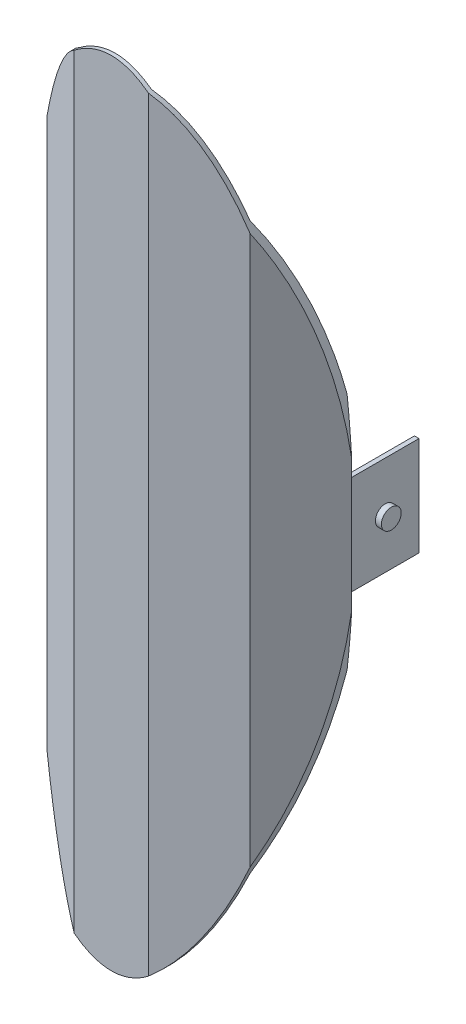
from build123d import *

# Parameters (mm, degrees)
SALIENTE_EXTRUIR1_DEPTH = 200
CROQUIS2_W              = 227.39485248
CROQUIS2_H              = 466.263757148
CROQUIS2_RX             = 200
CROQUIS2_RY             = 71
CORTAR_EXTRUIR1_DEPTH   = 400
CROQUIS4_W              = 2.309401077
CROQUIS4_H              = 50
SALIENTE_EXTRUIR2_DEPTH = 34
CROQUIS5_R              = 2
CORTAR_EXTRUIR2_DEPTH   = 172
CROQUIS6_R              = 5
SALIENTE_EXTRUIR3_DEPTH = 3


with BuildPart() as part:
    # Croquis1 → Saliente-Extruir1 (new, symmetric)
    with BuildSketch(Plane(origin=(0, 0, 0), x_dir=(1, 0, 0), z_dir=(0, 1, 0))):
        Polygon((-67.690598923, -18.75644347), (-49.779454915, -49.779454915), (-18.220545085, -68), (18.220545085, -68), (49.779454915, -49.779454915), (67.690598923, -18.75644347), (70, -18.75644347), (51.24355653, -51.24355653), (18.75644347, -70), (-18.75644347, -70), (-51.24355653, -51.24355653), (-70, -18.75644347), align=None)
    extrude(amount=SALIENTE_EXTRUIR1_DEPTH, both=True)

    # Croquis2 → Cortar-Extruir1 (cut)
    with BuildSketch(Plane.XY):
        Rectangle(CROQUIS2_W, CROQUIS2_H)
        with Locations(Location((0, 0), (0, 0, 90))):
            Ellipse(CROQUIS2_RX, CROQUIS2_RY, mode=Mode.SUBTRACT)
    extrude(amount=CORTAR_EXTRUIR1_DEPTH, mode=Mode.SUBTRACT)

    # Croquis4 → Saliente-Extruir2 (add)
    with BuildSketch(Plane(origin=(0, 0, 18.75644347), x_dir=(-1, 0, 0), z_dir=(0, 0, -1))):
        with Locations((68.845299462, 0)):
            Rectangle(CROQUIS4_W, CROQUIS4_H)
        with Locations((-68.845299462, 0)):
            Rectangle(CROQUIS4_W, CROQUIS4_H)
    extrude(amount=SALIENTE_EXTRUIR2_DEPTH)

    # Croquis5 → Cortar-Extruir2 (cut)
    with BuildSketch(Plane.ZY.offset(70)):
        with Locations((1.75644347, 0)):
            Circle(CROQUIS5_R)
    extrude(amount=-CORTAR_EXTRUIR2_DEPTH, mode=Mode.SUBTRACT)


with BuildPart() as body_2:
    # Croquis6 → Saliente-Extruir3 (new body)
    with BuildSketch(Plane.ZY.offset(70)):
        with Locations((1.75644347, 0)):
            Circle(CROQUIS6_R)
    extrude(amount=SALIENTE_EXTRUIR3_DEPTH)


with BuildPart() as body_3:
    # Simetr_a2: mirrored copy
    add(body_2.part.mirror(Plane(origin=(0, 0, 0), x_dir=(0, 0, 1), z_dir=(1, 0, 0))))


solid = Compound([part.part, body_2.part, body_3.part])
